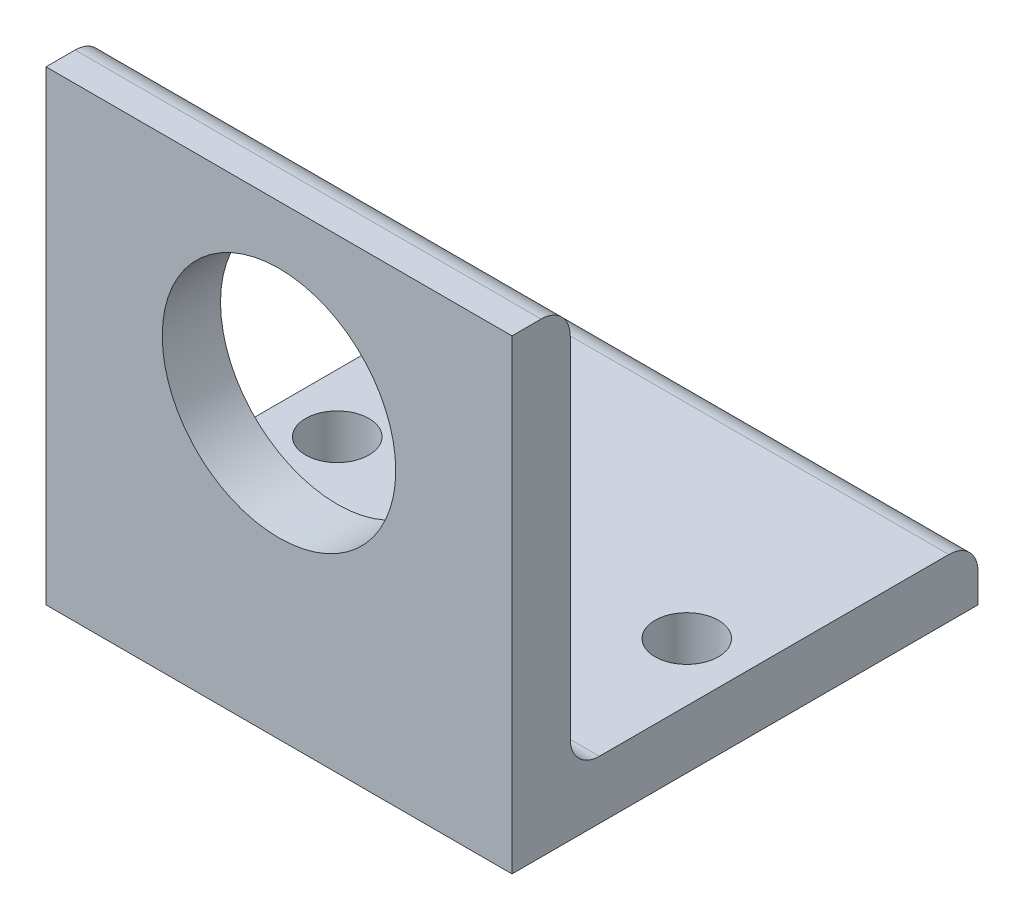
from build123d import *

# Parameters (mm, degrees)
BOSS_EXTRUDE1_DEPTH = 25.4
SKETCH3_R           = 6.3627
CUT_EXTRUDE1_DEPTH  = 43.240627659
SKETCH4_R           = 1.7272
CUT_EXTRUDE2_DEPTH  = 43.240627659
FILLET2_R           = 1.5875


with BuildPart() as part:
    # Sketch2 → Boss-Extrude1 (new body)
    with BuildSketch(Plane(origin=(0, 0, 0), x_dir=(0, 0, -1), z_dir=(1, 0, 0))):
        Polygon((0, 0), (25.4, 0), (25.4, 3.175), (3.175, 3.175), (3.175, 25.4), (0, 25.4), align=None)
    extrude(amount=BOSS_EXTRUDE1_DEPTH)

    # Sketch3 → Cut-Extrude1 (cut, through all)
    with BuildSketch(Plane(origin=(0, 0, -3.175), x_dir=(-1, 0, 0), z_dir=(0, 0, -1))):
        with Locations((-12.7, 15.875)):
            Circle(SKETCH3_R)
    extrude(amount=-CUT_EXTRUDE1_DEPTH, mode=Mode.SUBTRACT)

    # Sketch4 → Cut-Extrude2 (cut, through all)
    with BuildSketch(Plane(origin=(0, 3.175, 0), x_dir=(1, 0, 0), z_dir=(0, 1, 0))):
        with Locations(Location((3.175, 12.7, 0), (0, 0, 270))):
            Circle(SKETCH4_R)
        with Locations(Location((22.225, 12.7, 0), (0, 0, 270))):
            Circle(SKETCH4_R)
    extrude(amount=-CUT_EXTRUDE2_DEPTH, mode=Mode.SUBTRACT)

    # Fillet2
    fillet2_edges = [part.edges().sort_by_distance(p)[0] for p in [
        (12.7, 25.4, -3.175),
        (12.7, 3.175, -3.175),
        (12.7, 3.175, -25.4),
    ]]
    fillet(fillet2_edges, radius=FILLET2_R)


solid = part.part
